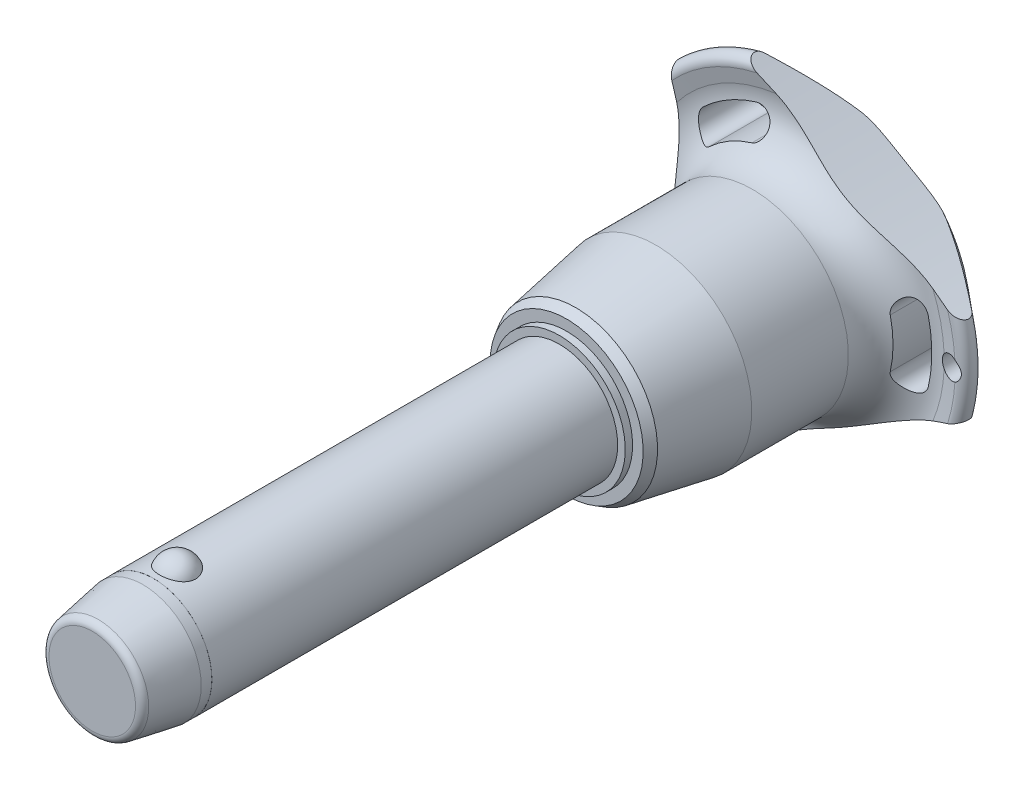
from build123d import *

# Parameters (mm, degrees)
SKETCH1_R           = 8
BOSS_EXTRUDE1_DEPTH = 50
SKETCH2_R           = 7
BOSS_EXTRUDE2_DEPTH = 39.7
BOSS_EXTRUDE3_START = 14
SKETCH1_2_R         = 8
BOSS_EXTRUDE3_DEPTH = 14
CHAMFER1_SIZE       = 7
CHAMFER1_SIZE2      = 1.234288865
FILLET1_R           = 1
SKETCH6_R           = 144.275
CUT_EXTRUDE1_DEPTH  = 96.809732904
CIRPATTERN1_COUNT   = 3
SKETCH7_R           = 1.5
CUT_EXTRUDE2_DEPTH  = 96.600036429
SKETCH8_R           = 8
SKETCH8_R_2         = 7.99
CUT_EXTRUDE3_DEPTH  = 8.4


with BuildPart() as part:
    # Sketch1 → Boss-Extrude1 (new body)
    with BuildSketch(Plane.XY):
        Circle(SKETCH1_R)
    extrude(amount=-BOSS_EXTRUDE1_DEPTH)

    # Sketch2 → Boss-Extrude2 (add)
    with BuildSketch(Plane(origin=(0, 0, -50), x_dir=(-1, 0, 0), z_dir=(0, 0, -1))):
        Circle(SKETCH2_R)
    extrude(amount=BOSS_EXTRUDE2_DEPTH)

    # Sketch3 → Revolve1 (revolve)
    with BuildSketch(Plane(origin=(0, 0, 0), x_dir=(0, 0, -1), z_dir=(1, 0, 0))):
        with BuildLine():
            Line((-2.387467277, 9.5), (-2.387467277, 4.2))
            ThreePointArc((-2.387467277, 4.2), (0.262532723, 6.85), (-2.387467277, 9.5))
        make_face()
        with BuildLine():
            Line((-2.387467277, -4.2), (-2.387467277, -9.5))
            ThreePointArc((-2.387467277, -9.5), (0.262532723, -6.85), (-2.387467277, -4.2))
        make_face()
    revolve(axis=Axis((0, -4.2, 2.387467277), (0, 1, 0)))

    # Sketch1_2 → Boss-Extrude3 (add)
    with BuildSketch(Plane.XY.offset(BOSS_EXTRUDE3_START)):
        Circle(SKETCH1_2_R)
    extrude(amount=-BOSS_EXTRUDE3_DEPTH)

    # Chamfer1
    chamfer1_edges = [part.edges().sort_by_distance(p)[0] for p in [
        (-8, 0, 14),
    ]]
    chamfer1_side = [part.faces().sort_by_distance(p)[0] for p in [
        (-8, 0, -18),
    ]]
    chamfer(chamfer1_edges, length=CHAMFER1_SIZE, length2=CHAMFER1_SIZE2, reference=chamfer1_side[0])

    # Fillet1
    fillet1_edges = [part.edges().sort_by_distance(p)[0] for p in [
        (-6.765711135, 0, 14),
        (7, 0, -89.7),
    ]]
    fillet(fillet1_edges, radius=FILLET1_R)

    # Sketch4 → Revolve2 (revolve)
    with BuildSketch(Plane(origin=(0, 0, 0), x_dir=(0, 0, -1), z_dir=(1, 0, 0)), mode=Mode.PRIVATE) as revolve2_sk:
        Polygon((50, 0), (50, 9.044607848), (51, 9.044607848), (51, 10.490707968), (52.25235944, 11.213758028), (63.233333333, 13.15), (76.466666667, 13.15), (76.466666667, 0), align=None)
    revolve(revolve2_sk.sketch.rotate(Axis((0, 0, -76.466666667), (0, 0, 1)), 90), axis=Axis((0, 0, -76.466666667), (0, 0, 1)))

    # Sketch5 → Revolve3 (revolve)
    with BuildSketch(Plane(origin=(0, 0, 0), x_dir=(0, 0, -1), z_dir=(1, 0, 0)), mode=Mode.PRIVATE) as revolve3_sk:
        with BuildLine():
            Line((82.32877039, 20.428960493), (81.910912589, 22.344207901))
            ThreePointArc((81.910912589, 22.344207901), (82.554394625, 23.677136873), (84.002586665, 23.371345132))
            Line((84.002586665, 23.371345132), (89.141488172, 17.247040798))
            ThreePointArc((89.141488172, 17.247040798), (89.7, 15.584758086), (88.978803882, 13.986322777))
            ThreePointArc((88.978803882, 13.986322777), (84.617427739, 7.589034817), (83.083333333, 0))
            Line((83.083333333, 0), (76.466666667, 0))
            Line((76.466666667, 0), (76.466666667, 13.15))
            ThreePointArc((76.466666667, 13.15), (81.139661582, 15.38660811), (82.32877039, 20.428960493))
        make_face()
    revolve(revolve3_sk.sketch.rotate(Axis((0, 0, -83.083333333), (0, 0, 1)), 90), axis=Axis((0, 0, -83.083333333), (0, 0, 1)))

    # Sketch6 → Cut-Extrude1 (cut, through all)
    with BuildSketch(Plane.XY):
        with Locations((-159.975, 0)):
            Circle(SKETCH6_R)
        with BuildLine():
            ThreePointArc((18.131206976, -4.190753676), (18.60922037, 0), (18.131206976, 4.190753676))
            ThreePointArc((18.131206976, 4.190753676), (15.94840906, 5.553949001), (14.585213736, 3.371151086))
            ThreePointArc((14.585213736, 3.371151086), (14.969740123, 0), (14.585213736, -3.371151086))
            ThreePointArc((14.585213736, -3.371151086), (15.94840906, -5.553949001), (18.131206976, -4.190753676))
        make_face()
    cut_extrude1 = extrude(amount=-CUT_EXTRUDE1_DEPTH, mode=Mode.SUBTRACT)

    # CirPattern1: Cut-Extrude1 ×3 about axis
    cirpattern1_axis = Axis((0, 0, 0), (0, 0, 1))
    for i in range(1, CIRPATTERN1_COUNT):
        add(cut_extrude1.rotate(cirpattern1_axis, i * 360 / CIRPATTERN1_COUNT), mode=Mode.SUBTRACT)

    # Sketch7 → Cut-Extrude2 (cut, through all)
    with BuildSketch(Plane.XY):
        with Locations(Location((21.60922037, 0, 0), (0, 0, 297.620773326))):
            Circle(SKETCH7_R)
    extrude(amount=-CUT_EXTRUDE2_DEPTH, mode=Mode.SUBTRACT)

    # Sketch8 → Cut-Extrude3 (cut)
    with BuildSketch(Plane.XY.offset(14)):
        Circle(SKETCH8_R)
        Circle(SKETCH8_R_2, mode=Mode.SUBTRACT)
    extrude(amount=-CUT_EXTRUDE3_DEPTH, mode=Mode.SUBTRACT)


solid = part.part
